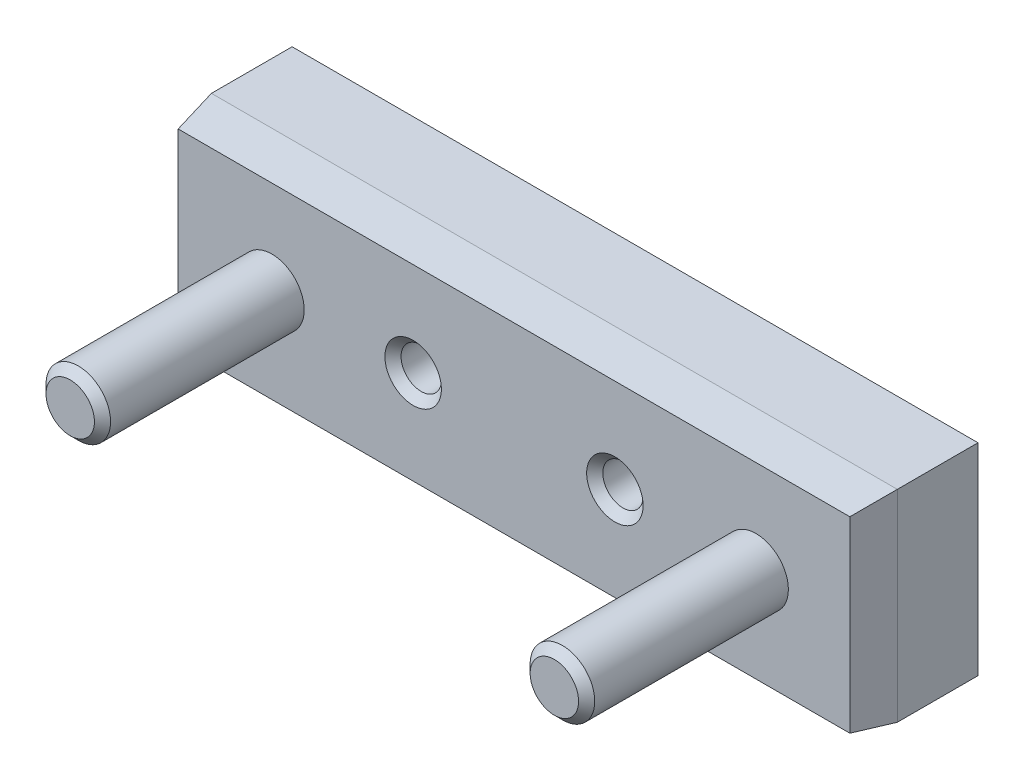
ISO-10303-21;
HEADER;
FILE_DESCRIPTION(('STEP AP214'),'2;1');
FILE_NAME('part.step','',(''),(''),'','','');
FILE_SCHEMA(('AUTOMOTIVE_DESIGN { 1 0 10303 214 1 1 1 1 }'));
ENDSEC;
DATA;
#1=APPLICATION_CONTEXT('core data for automotive mechanical design processes');
#2=APPLICATION_PROTOCOL_DEFINITION('international standard','automotive_design',2000,#1);
#3=PRODUCT_CONTEXT('',#1,'mechanical');
#4=PRODUCT('Part','Part','',(#3));
#5=PRODUCT_RELATED_PRODUCT_CATEGORY('part','',(#4));
#6=PRODUCT_DEFINITION_FORMATION('','',#4);
#7=PRODUCT_DEFINITION_CONTEXT('part definition',#1,'design');
#8=PRODUCT_DEFINITION('design','',#6,#7);
#9=PRODUCT_DEFINITION_SHAPE('','',#8);
#10=(LENGTH_UNIT() NAMED_UNIT(*) SI_UNIT(.MILLI.,.METRE.));
#11=(NAMED_UNIT(*) PLANE_ANGLE_UNIT() SI_UNIT($,.RADIAN.));
#12=(NAMED_UNIT(*) SI_UNIT($,.STERADIAN.) SOLID_ANGLE_UNIT());
#13=UNCERTAINTY_MEASURE_WITH_UNIT(LENGTH_MEASURE(1.E-05),#10,'distance_accuracy_value','');
#14=(GEOMETRIC_REPRESENTATION_CONTEXT(3) GLOBAL_UNCERTAINTY_ASSIGNED_CONTEXT((#13)) GLOBAL_UNIT_ASSIGNED_CONTEXT((#10,
#11,#12)) REPRESENTATION_CONTEXT('',''));
#15=CARTESIAN_POINT('',(0.,0.,0.));
#16=DIRECTION('',(0.,0.,1.));
#17=DIRECTION('',(1.,0.,0.));
#18=AXIS2_PLACEMENT_3D('',#15,#16,#17);
#19=CARTESIAN_POINT('',(-42.5,25.,15.));
#20=DIRECTION('',(0.,0.,1.));
#21=DIRECTION('',(1.,0.,0.));
#22=AXIS2_PLACEMENT_3D('',#19,#20,#21);
#23=PLANE('',#22);
#24=DIRECTION('',(-1.,0.,0.));
#25=VECTOR('',#24,1.);
#26=CARTESIAN_POINT('',(-42.5,24.1183650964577,15.));
#27=LINE('',#26,#25);
#28=CARTESIAN_POINT('',(41.6183650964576,24.1183650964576,15.));
#29=VERTEX_POINT('',#28);
#30=CARTESIAN_POINT('',(-41.6183650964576,24.1183650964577,15.));
#31=VERTEX_POINT('',#30);
#32=EDGE_CURVE('E144',#29,#31,#27,.T.);
#33=ORIENTED_EDGE('',*,*,#32,.T.);
#34=DIRECTION('',(0.,-1.,0.));
#35=VECTOR('',#34,1.);
#36=CARTESIAN_POINT('',(-41.6183650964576,0.,15.));
#37=LINE('',#36,#35);
#38=CARTESIAN_POINT('',(-41.6183650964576,0.881634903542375,15.));
#39=VERTEX_POINT('',#38);
#40=EDGE_CURVE('E146',#31,#39,#37,.T.);
#41=ORIENTED_EDGE('',*,*,#40,.T.);
#42=DIRECTION('',(1.,0.,0.));
#43=VECTOR('',#42,1.);
#44=CARTESIAN_POINT('',(-42.5,0.881634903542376,15.));
#45=LINE('',#44,#43);
#46=CARTESIAN_POINT('',(41.6183650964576,0.88163490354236,15.));
#47=VERTEX_POINT('',#46);
#48=EDGE_CURVE('E142',#39,#47,#45,.T.);
#49=ORIENTED_EDGE('',*,*,#48,.T.);
#50=DIRECTION('',(0.,1.,0.));
#51=VECTOR('',#50,1.);
#52=CARTESIAN_POINT('',(41.6183650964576,25.,15.));
#53=LINE('',#52,#51);
#54=EDGE_CURVE('E140',#47,#29,#53,.T.);
#55=ORIENTED_EDGE('',*,*,#54,.T.);
#56=EDGE_LOOP('',(#33,#41,#49,#55));
#57=FACE_BOUND('',#56,.T.);
#58=CARTESIAN_POINT('',(12.5,12.5,15.));
#59=DIRECTION('',(0.,0.,1.));
#60=DIRECTION('',(1.,0.,0.));
#61=AXIS2_PLACEMENT_3D('',#58,#59,#60);
#62=CIRCLE('',#61,3.50000000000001);
#63=CARTESIAN_POINT('',(16.,12.5,15.));
#64=VERTEX_POINT('',#63);
#65=EDGE_CURVE('E122',#64,#64,#62,.F.);
#66=ORIENTED_EDGE('',*,*,#65,.T.);
#67=EDGE_LOOP('',(#66));
#68=FACE_BOUND('',#67,.T.);
#69=CARTESIAN_POINT('',(-12.5,12.5,15.));
#70=DIRECTION('',(0.,0.,1.));
#71=DIRECTION('',(1.,0.,0.));
#72=AXIS2_PLACEMENT_3D('',#69,#70,#71);
#73=CIRCLE('',#72,3.50000000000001);
#74=CARTESIAN_POINT('',(-8.99999999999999,12.5,15.));
#75=VERTEX_POINT('',#74);
#76=EDGE_CURVE('E119',#75,#75,#73,.F.);
#77=ORIENTED_EDGE('',*,*,#76,.T.);
#78=EDGE_LOOP('',(#77));
#79=FACE_BOUND('',#78,.T.);
#80=CARTESIAN_POINT('',(-30.,12.5,15.));
#81=DIRECTION('',(0.,0.,1.));
#82=DIRECTION('',(1.,0.,0.));
#83=AXIS2_PLACEMENT_3D('',#80,#81,#82);
#84=CIRCLE('',#83,4.);
#85=CARTESIAN_POINT('',(-26.,12.5,15.));
#86=VERTEX_POINT('',#85);
#87=EDGE_CURVE('E91',#86,#86,#84,.T.);
#88=ORIENTED_EDGE('',*,*,#87,.F.);
#89=EDGE_LOOP('',(#88));
#90=FACE_BOUND('',#89,.T.);
#91=CARTESIAN_POINT('',(30.,12.5,15.));
#92=DIRECTION('',(0.,0.,1.));
#93=DIRECTION('',(1.,0.,0.));
#94=AXIS2_PLACEMENT_3D('',#91,#92,#93);
#95=CIRCLE('',#94,4.00000000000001);
#96=CARTESIAN_POINT('',(34.,12.5,15.));
#97=VERTEX_POINT('',#96);
#98=EDGE_CURVE('E100',#97,#97,#95,.T.);
#99=ORIENTED_EDGE('',*,*,#98,.F.);
#100=EDGE_LOOP('',(#99));
#101=FACE_BOUND('',#100,.T.);
#102=ADVANCED_FACE('F30',(#57,#68,#79,#90,#101),#23,.T.);
#103=CARTESIAN_POINT('',(-42.5,25.,15.));
#104=DIRECTION('',(1.,0.,0.));
#105=DIRECTION('',(0.,1.,0.));
#106=AXIS2_PLACEMENT_3D('',#103,#104,#105);
#107=PLANE('',#106);
#108=DIRECTION('',(0.,0.,-1.));
#109=VECTOR('',#108,1.);
#110=CARTESIAN_POINT('',(-42.5,0.,15.));
#111=LINE('',#110,#109);
#112=CARTESIAN_POINT('',(-42.5,0.,9.99999999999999));
#113=VERTEX_POINT('',#112);
#114=CARTESIAN_POINT('',(-42.5,0.,0.));
#115=VERTEX_POINT('',#114);
#116=EDGE_CURVE('E82',#113,#115,#111,.T.);
#117=ORIENTED_EDGE('',*,*,#116,.F.);
#118=DIRECTION('',(0.,1.,0.));
#119=VECTOR('',#118,1.);
#120=CARTESIAN_POINT('',(-42.5,25.,9.99999999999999));
#121=LINE('',#120,#119);
#122=CARTESIAN_POINT('',(-42.5,25.,9.99999999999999));
#123=VERTEX_POINT('',#122);
#124=EDGE_CURVE('E149',#113,#123,#121,.T.);
#125=ORIENTED_EDGE('',*,*,#124,.T.);
#126=DIRECTION('',(0.,0.,-1.));
#127=VECTOR('',#126,1.);
#128=CARTESIAN_POINT('',(-42.5,25.,15.));
#129=LINE('',#128,#127);
#130=CARTESIAN_POINT('',(-42.5,25.,0.));
#131=VERTEX_POINT('',#130);
#132=EDGE_CURVE('E96',#123,#131,#129,.T.);
#133=ORIENTED_EDGE('',*,*,#132,.T.);
#134=DIRECTION('',(0.,-1.,0.));
#135=VECTOR('',#134,1.);
#136=CARTESIAN_POINT('',(-42.5,25.,0.));
#137=LINE('',#136,#135);
#138=EDGE_CURVE('E95',#131,#115,#137,.T.);
#139=ORIENTED_EDGE('',*,*,#138,.T.);
#140=EDGE_LOOP('',(#117,#125,#133,#139));
#141=FACE_BOUND('',#140,.T.);
#142=ADVANCED_FACE('F32',(#141),#107,.F.);
#143=CARTESIAN_POINT('',(42.5,0.,15.));
#144=DIRECTION('',(0.,-1.,0.));
#145=DIRECTION('',(1.,0.,0.));
#146=AXIS2_PLACEMENT_3D('',#143,#144,#145);
#147=PLANE('',#146);
#148=DIRECTION('',(0.,0.,-1.));
#149=VECTOR('',#148,1.);
#150=CARTESIAN_POINT('',(42.5,0.,15.));
#151=LINE('',#150,#149);
#152=CARTESIAN_POINT('',(42.5,0.,9.99999999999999));
#153=VERTEX_POINT('',#152);
#154=CARTESIAN_POINT('',(42.5,0.,0.));
#155=VERTEX_POINT('',#154);
#156=EDGE_CURVE('E92',#153,#155,#151,.T.);
#157=ORIENTED_EDGE('',*,*,#156,.F.);
#158=DIRECTION('',(-1.,0.,0.));
#159=VECTOR('',#158,1.);
#160=CARTESIAN_POINT('',(42.5,0.,9.99999999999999));
#161=LINE('',#160,#159);
#162=EDGE_CURVE('E38',#153,#113,#161,.T.);
#163=ORIENTED_EDGE('',*,*,#162,.T.);
#164=ORIENTED_EDGE('',*,*,#116,.T.);
#165=DIRECTION('',(-1.,0.,0.));
#166=VECTOR('',#165,1.);
#167=CARTESIAN_POINT('',(42.5,0.,0.));
#168=LINE('',#167,#166);
#169=EDGE_CURVE('E86',#155,#115,#168,.T.);
#170=ORIENTED_EDGE('',*,*,#169,.F.);
#171=EDGE_LOOP('',(#157,#163,#164,#170));
#172=FACE_BOUND('',#171,.T.);
#173=ADVANCED_FACE('F84',(#172),#147,.T.);
#174=CARTESIAN_POINT('',(42.5,0.,15.));
#175=DIRECTION('',(-1.,0.,0.));
#176=DIRECTION('',(0.,0.,1.));
#177=AXIS2_PLACEMENT_3D('',#174,#175,#176);
#178=PLANE('',#177);
#179=DIRECTION('',(0.,0.,-1.));
#180=VECTOR('',#179,1.);
#181=CARTESIAN_POINT('',(42.5,25.,15.));
#182=LINE('',#181,#180);
#183=CARTESIAN_POINT('',(42.5,25.,9.99999999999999));
#184=VERTEX_POINT('',#183);
#185=CARTESIAN_POINT('',(42.5,25.,0.));
#186=VERTEX_POINT('',#185);
#187=EDGE_CURVE('E113',#184,#186,#182,.T.);
#188=ORIENTED_EDGE('',*,*,#187,.F.);
#189=DIRECTION('',(0.,-1.,0.));
#190=VECTOR('',#189,1.);
#191=CARTESIAN_POINT('',(42.5,0.,9.99999999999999));
#192=LINE('',#191,#190);
#193=EDGE_CURVE('E11',#184,#153,#192,.T.);
#194=ORIENTED_EDGE('',*,*,#193,.T.);
#195=ORIENTED_EDGE('',*,*,#156,.T.);
#196=DIRECTION('',(0.,1.,0.));
#197=VECTOR('',#196,1.);
#198=CARTESIAN_POINT('',(42.5,0.,0.));
#199=LINE('',#198,#197);
#200=EDGE_CURVE('E105',#155,#186,#199,.T.);
#201=ORIENTED_EDGE('',*,*,#200,.T.);
#202=EDGE_LOOP('',(#188,#194,#195,#201));
#203=FACE_BOUND('',#202,.T.);
#204=ADVANCED_FACE('F154',(#203),#178,.F.);
#205=CARTESIAN_POINT('',(-42.5,25.,15.));
#206=DIRECTION('',(0.,1.,0.));
#207=DIRECTION('',(-1.,0.,0.));
#208=AXIS2_PLACEMENT_3D('',#205,#206,#207);
#209=PLANE('',#208);
#210=ORIENTED_EDGE('',*,*,#132,.F.);
#211=DIRECTION('',(1.,0.,0.));
#212=VECTOR('',#211,1.);
#213=CARTESIAN_POINT('',(-42.5,25.,9.99999999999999));
#214=LINE('',#213,#212);
#215=EDGE_CURVE('E51',#123,#184,#214,.T.);
#216=ORIENTED_EDGE('',*,*,#215,.T.);
#217=ORIENTED_EDGE('',*,*,#187,.T.);
#218=DIRECTION('',(1.,0.,0.));
#219=VECTOR('',#218,1.);
#220=CARTESIAN_POINT('',(-42.5,25.,0.));
#221=LINE('',#220,#219);
#222=EDGE_CURVE('E107',#131,#186,#221,.T.);
#223=ORIENTED_EDGE('',*,*,#222,.F.);
#224=EDGE_LOOP('',(#210,#216,#217,#223));
#225=FACE_BOUND('',#224,.T.);
#226=ADVANCED_FACE('F153',(#225),#209,.T.);
#227=CARTESIAN_POINT('',(-42.5,25.,0.));
#228=DIRECTION('',(0.,0.,1.));
#229=DIRECTION('',(1.,0.,0.));
#230=AXIS2_PLACEMENT_3D('',#227,#228,#229);
#231=PLANE('',#230);
#232=CARTESIAN_POINT('',(12.5,12.5,0.));
#233=DIRECTION('',(0.,0.,1.));
#234=DIRECTION('',(1.,0.,0.));
#235=AXIS2_PLACEMENT_3D('',#232,#233,#234);
#236=CIRCLE('',#235,2.5);
#237=CARTESIAN_POINT('',(15.,12.5,0.));
#238=VERTEX_POINT('',#237);
#239=EDGE_CURVE('E175',#238,#238,#236,.T.);
#240=ORIENTED_EDGE('',*,*,#239,.T.);
#241=EDGE_LOOP('',(#240));
#242=FACE_BOUND('',#241,.T.);
#243=CARTESIAN_POINT('',(-12.5,12.5,0.));
#244=DIRECTION('',(0.,0.,1.));
#245=DIRECTION('',(1.,0.,0.));
#246=AXIS2_PLACEMENT_3D('',#243,#244,#245);
#247=CIRCLE('',#246,2.5);
#248=CARTESIAN_POINT('',(-10.,12.5,0.));
#249=VERTEX_POINT('',#248);
#250=EDGE_CURVE('E178',#249,#249,#247,.T.);
#251=ORIENTED_EDGE('',*,*,#250,.T.);
#252=EDGE_LOOP('',(#251));
#253=FACE_BOUND('',#252,.T.);
#254=ORIENTED_EDGE('',*,*,#138,.F.);
#255=ORIENTED_EDGE('',*,*,#222,.T.);
#256=ORIENTED_EDGE('',*,*,#200,.F.);
#257=ORIENTED_EDGE('',*,*,#169,.T.);
#258=EDGE_LOOP('',(#254,#255,#256,#257));
#259=FACE_BOUND('',#258,.T.);
#260=ADVANCED_FACE('F103',(#242,#253,#259),#231,.F.);
#261=CARTESIAN_POINT('',(-30.,12.5,40.));
#262=DIRECTION('',(0.,0.,-1.));
#263=DIRECTION('',(-1.,0.,0.));
#264=AXIS2_PLACEMENT_3D('',#261,#262,#263);
#265=CYLINDRICAL_SURFACE('',#264,4.);
#266=CARTESIAN_POINT('',(-30.,12.5,39.));
#267=DIRECTION('',(0.,0.,1.));
#268=DIRECTION('',(1.,0.,0.));
#269=AXIS2_PLACEMENT_3D('',#266,#267,#268);
#270=CIRCLE('',#269,4.);
#271=CARTESIAN_POINT('',(-26.,12.5,39.));
#272=VERTEX_POINT('',#271);
#273=EDGE_CURVE('E131',#272,#272,#270,.F.);
#274=ORIENTED_EDGE('',*,*,#273,.T.);
#275=EDGE_LOOP('',(#274));
#276=FACE_BOUND('',#275,.T.);
#277=ORIENTED_EDGE('',*,*,#87,.T.);
#278=EDGE_LOOP('',(#277));
#279=FACE_BOUND('',#278,.T.);
#280=ADVANCED_FACE('F185',(#276,#279),#265,.T.);
#281=CARTESIAN_POINT('',(-30.,12.5,40.));
#282=DIRECTION('',(0.,0.,1.));
#283=DIRECTION('',(1.,0.,0.));
#284=AXIS2_PLACEMENT_3D('',#281,#282,#283);
#285=PLANE('',#284);
#286=CARTESIAN_POINT('',(-30.,12.5,40.));
#287=DIRECTION('',(0.,0.,1.));
#288=DIRECTION('',(1.,0.,0.));
#289=AXIS2_PLACEMENT_3D('',#286,#287,#288);
#290=CIRCLE('',#289,2.99999999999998);
#291=CARTESIAN_POINT('',(-27.,12.5,40.));
#292=VERTEX_POINT('',#291);
#293=EDGE_CURVE('E128',#292,#292,#290,.T.);
#294=ORIENTED_EDGE('',*,*,#293,.T.);
#295=EDGE_LOOP('',(#294));
#296=FACE_BOUND('',#295,.T.);
#297=ADVANCED_FACE('F196',(#296),#285,.T.);
#298=CARTESIAN_POINT('',(30.,12.5,40.));
#299=DIRECTION('',(0.,0.,-1.));
#300=DIRECTION('',(-1.,0.,0.));
#301=AXIS2_PLACEMENT_3D('',#298,#299,#300);
#302=CYLINDRICAL_SURFACE('',#301,4.00000000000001);
#303=CARTESIAN_POINT('',(30.,12.5,39.));
#304=DIRECTION('',(0.,0.,1.));
#305=DIRECTION('',(1.,0.,0.));
#306=AXIS2_PLACEMENT_3D('',#303,#304,#305);
#307=CIRCLE('',#306,4.00000000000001);
#308=CARTESIAN_POINT('',(34.,12.5,39.));
#309=VERTEX_POINT('',#308);
#310=EDGE_CURVE('E137',#309,#309,#307,.F.);
#311=ORIENTED_EDGE('',*,*,#310,.T.);
#312=EDGE_LOOP('',(#311));
#313=FACE_BOUND('',#312,.T.);
#314=ORIENTED_EDGE('',*,*,#98,.T.);
#315=EDGE_LOOP('',(#314));
#316=FACE_BOUND('',#315,.T.);
#317=ADVANCED_FACE('F193',(#313,#316),#302,.T.);
#318=CARTESIAN_POINT('',(30.,12.5,40.));
#319=DIRECTION('',(0.,0.,1.));
#320=DIRECTION('',(1.,0.,0.));
#321=AXIS2_PLACEMENT_3D('',#318,#319,#320);
#322=PLANE('',#321);
#323=CARTESIAN_POINT('',(30.,12.5,40.));
#324=DIRECTION('',(0.,0.,1.));
#325=DIRECTION('',(1.,0.,0.));
#326=AXIS2_PLACEMENT_3D('',#323,#324,#325);
#327=CIRCLE('',#326,2.99999999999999);
#328=CARTESIAN_POINT('',(33.,12.5,40.));
#329=VERTEX_POINT('',#328);
#330=EDGE_CURVE('E134',#329,#329,#327,.T.);
#331=ORIENTED_EDGE('',*,*,#330,.T.);
#332=EDGE_LOOP('',(#331));
#333=FACE_BOUND('',#332,.T.);
#334=ADVANCED_FACE('F195',(#333),#322,.T.);
#335=CARTESIAN_POINT('',(-12.5,12.5,0.));
#336=DIRECTION('',(0.,0.,1.));
#337=DIRECTION('',(1.,0.,0.));
#338=AXIS2_PLACEMENT_3D('',#335,#336,#337);
#339=CYLINDRICAL_SURFACE('',#338,2.5);
#340=CARTESIAN_POINT('',(-12.5,12.5,14.));
#341=DIRECTION('',(0.,0.,1.));
#342=DIRECTION('',(1.,0.,0.));
#343=AXIS2_PLACEMENT_3D('',#340,#341,#342);
#344=CIRCLE('',#343,2.5);
#345=CARTESIAN_POINT('',(-10.,12.5,14.));
#346=VERTEX_POINT('',#345);
#347=EDGE_CURVE('E125',#346,#346,#344,.T.);
#348=ORIENTED_EDGE('',*,*,#347,.T.);
#349=EDGE_LOOP('',(#348));
#350=FACE_BOUND('',#349,.T.);
#351=ORIENTED_EDGE('',*,*,#250,.F.);
#352=EDGE_LOOP('',(#351));
#353=FACE_BOUND('',#352,.T.);
#354=ADVANCED_FACE('F203',(#350,#353),#339,.F.);
#355=CARTESIAN_POINT('',(12.5,12.5,0.));
#356=DIRECTION('',(0.,0.,1.));
#357=DIRECTION('',(1.,0.,0.));
#358=AXIS2_PLACEMENT_3D('',#355,#356,#357);
#359=CYLINDRICAL_SURFACE('',#358,2.5);
#360=CARTESIAN_POINT('',(12.5,12.5,14.));
#361=DIRECTION('',(0.,0.,1.));
#362=DIRECTION('',(1.,0.,0.));
#363=AXIS2_PLACEMENT_3D('',#360,#361,#362);
#364=CIRCLE('',#363,2.5);
#365=CARTESIAN_POINT('',(15.,12.5,14.));
#366=VERTEX_POINT('',#365);
#367=EDGE_CURVE('E116',#366,#366,#364,.T.);
#368=ORIENTED_EDGE('',*,*,#367,.T.);
#369=EDGE_LOOP('',(#368));
#370=FACE_BOUND('',#369,.T.);
#371=ORIENTED_EDGE('',*,*,#239,.F.);
#372=EDGE_LOOP('',(#371));
#373=FACE_BOUND('',#372,.T.);
#374=ADVANCED_FACE('F265',(#370,#373),#359,.F.);
#375=CARTESIAN_POINT('',(12.5,12.5,14.));
#376=DIRECTION('',(0.,0.,1.));
#377=DIRECTION('',(1.,0.,0.));
#378=AXIS2_PLACEMENT_3D('',#375,#376,#377);
#379=CONICAL_SURFACE('',#378,2.5,0.785398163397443);
#380=ORIENTED_EDGE('',*,*,#65,.F.);
#381=EDGE_LOOP('',(#380));
#382=FACE_BOUND('',#381,.T.);
#383=ORIENTED_EDGE('',*,*,#367,.F.);
#384=EDGE_LOOP('',(#383));
#385=FACE_BOUND('',#384,.T.);
#386=ADVANCED_FACE('F273',(#382,#385),#379,.F.);
#387=CARTESIAN_POINT('',(-12.5,12.5,14.));
#388=DIRECTION('',(0.,0.,1.));
#389=DIRECTION('',(1.,0.,0.));
#390=AXIS2_PLACEMENT_3D('',#387,#388,#389);
#391=CONICAL_SURFACE('',#390,2.5,0.785398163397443);
#392=ORIENTED_EDGE('',*,*,#76,.F.);
#393=EDGE_LOOP('',(#392));
#394=FACE_BOUND('',#393,.T.);
#395=ORIENTED_EDGE('',*,*,#347,.F.);
#396=EDGE_LOOP('',(#395));
#397=FACE_BOUND('',#396,.T.);
#398=ADVANCED_FACE('F282',(#394,#397),#391,.F.);
#399=CARTESIAN_POINT('',(-30.,12.5,40.));
#400=DIRECTION('',(0.,0.,-1.));
#401=DIRECTION('',(-1.,0.,0.));
#402=AXIS2_PLACEMENT_3D('',#399,#400,#401);
#403=CONICAL_SURFACE('',#402,2.99999999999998,0.785398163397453);
#404=ORIENTED_EDGE('',*,*,#273,.F.);
#405=EDGE_LOOP('',(#404));
#406=FACE_BOUND('',#405,.T.);
#407=ORIENTED_EDGE('',*,*,#293,.F.);
#408=EDGE_LOOP('',(#407));
#409=FACE_BOUND('',#408,.T.);
#410=ADVANCED_FACE('F291',(#406,#409),#403,.T.);
#411=CARTESIAN_POINT('',(30.,12.5,40.));
#412=DIRECTION('',(0.,0.,-1.));
#413=DIRECTION('',(-1.,0.,0.));
#414=AXIS2_PLACEMENT_3D('',#411,#412,#413);
#415=CONICAL_SURFACE('',#414,2.99999999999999,0.785398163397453);
#416=ORIENTED_EDGE('',*,*,#310,.F.);
#417=EDGE_LOOP('',(#416));
#418=FACE_BOUND('',#417,.T.);
#419=ORIENTED_EDGE('',*,*,#330,.F.);
#420=EDGE_LOOP('',(#419));
#421=FACE_BOUND('',#420,.T.);
#422=ADVANCED_FACE('F300',(#418,#421),#415,.T.);
#423=CARTESIAN_POINT('',(41.6183650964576,25.,15.));
#424=DIRECTION('',(0.984807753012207,0.,0.173648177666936));
#425=DIRECTION('',(0.173648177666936,0.,-0.984807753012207));
#426=AXIS2_PLACEMENT_3D('',#423,#424,#425);
#427=PLANE('',#426);
#428=DIRECTION('',(-0.171087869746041,0.171087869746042,0.970287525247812));
#429=VECTOR('',#428,1.);
#430=CARTESIAN_POINT('',(40.9123950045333,1.58760499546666,19.003755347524));
#431=LINE('',#430,#429);
#432=EDGE_CURVE('E159',#153,#47,#431,.T.);
#433=ORIENTED_EDGE('',*,*,#432,.F.);
#434=ORIENTED_EDGE('',*,*,#193,.F.);
#435=DIRECTION('',(0.171087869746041,0.171087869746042,-0.970287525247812));
#436=VECTOR('',#435,1.);
#437=CARTESIAN_POINT('',(41.6441714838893,24.1441714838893,14.8536447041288));
#438=LINE('',#437,#436);
#439=EDGE_CURVE('E165',#29,#184,#438,.T.);
#440=ORIENTED_EDGE('',*,*,#439,.F.);
#441=ORIENTED_EDGE('',*,*,#54,.F.);
#442=EDGE_LOOP('',(#433,#434,#440,#441));
#443=FACE_BOUND('',#442,.T.);
#444=ADVANCED_FACE('F160',(#443),#427,.T.);
#445=CARTESIAN_POINT('',(-42.5,25.,9.99999999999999));
#446=DIRECTION('',(0.,-0.984807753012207,-0.173648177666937));
#447=DIRECTION('',(0.,0.173648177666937,-0.984807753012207));
#448=AXIS2_PLACEMENT_3D('',#445,#446,#447);
#449=PLANE('',#448);
#450=ORIENTED_EDGE('',*,*,#439,.T.);
#451=ORIENTED_EDGE('',*,*,#215,.F.);
#452=DIRECTION('',(-0.171087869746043,0.171087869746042,-0.970287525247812));
#453=VECTOR('',#452,1.);
#454=CARTESIAN_POINT('',(-42.5,25.,9.99999999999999));
#455=LINE('',#454,#453);
#456=EDGE_CURVE('E166',#31,#123,#455,.T.);
#457=ORIENTED_EDGE('',*,*,#456,.F.);
#458=ORIENTED_EDGE('',*,*,#32,.F.);
#459=EDGE_LOOP('',(#450,#451,#457,#458));
#460=FACE_BOUND('',#459,.T.);
#461=ADVANCED_FACE('F317',(#460),#449,.F.);
#462=CARTESIAN_POINT('',(42.5,0.,9.99999999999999));
#463=DIRECTION('',(0.,0.984807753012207,-0.173648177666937));
#464=DIRECTION('',(0.,0.173648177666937,0.984807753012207));
#465=AXIS2_PLACEMENT_3D('',#462,#463,#464);
#466=PLANE('',#465);
#467=ORIENTED_EDGE('',*,*,#432,.T.);
#468=ORIENTED_EDGE('',*,*,#48,.F.);
#469=DIRECTION('',(0.171087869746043,0.171087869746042,0.970287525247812));
#470=VECTOR('',#469,1.);
#471=CARTESIAN_POINT('',(-40.0119599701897,2.4880400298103,24.1103761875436));
#472=LINE('',#471,#470);
#473=EDGE_CURVE('E169',#113,#39,#472,.T.);
#474=ORIENTED_EDGE('',*,*,#473,.F.);
#475=ORIENTED_EDGE('',*,*,#162,.F.);
#476=EDGE_LOOP('',(#467,#468,#474,#475));
#477=FACE_BOUND('',#476,.T.);
#478=ADVANCED_FACE('F168',(#477),#466,.F.);
#479=CARTESIAN_POINT('',(-41.6183650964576,25.,15.));
#480=DIRECTION('',(-0.984807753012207,0.,0.173648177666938));
#481=DIRECTION('',(0.173648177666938,0.,0.984807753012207));
#482=AXIS2_PLACEMENT_3D('',#479,#480,#481);
#483=PLANE('',#482);
#484=ORIENTED_EDGE('',*,*,#456,.T.);
#485=ORIENTED_EDGE('',*,*,#124,.F.);
#486=ORIENTED_EDGE('',*,*,#473,.T.);
#487=ORIENTED_EDGE('',*,*,#40,.F.);
#488=EDGE_LOOP('',(#484,#485,#486,#487));
#489=FACE_BOUND('',#488,.T.);
#490=ADVANCED_FACE('F333',(#489),#483,.T.);
#491=CLOSED_SHELL('',(#102,#142,#173,#204,#226,#260,#280,#297,#317,#334,#354,#374,#386,#398,
#410,#422,#444,#461,#478,#490));
#492=MANIFOLD_SOLID_BREP('B2',#491);
#493=ADVANCED_BREP_SHAPE_REPRESENTATION('',(#18,#492),#14);
#494=SHAPE_DEFINITION_REPRESENTATION(#9,#493);
ENDSEC;
END-ISO-10303-21;
